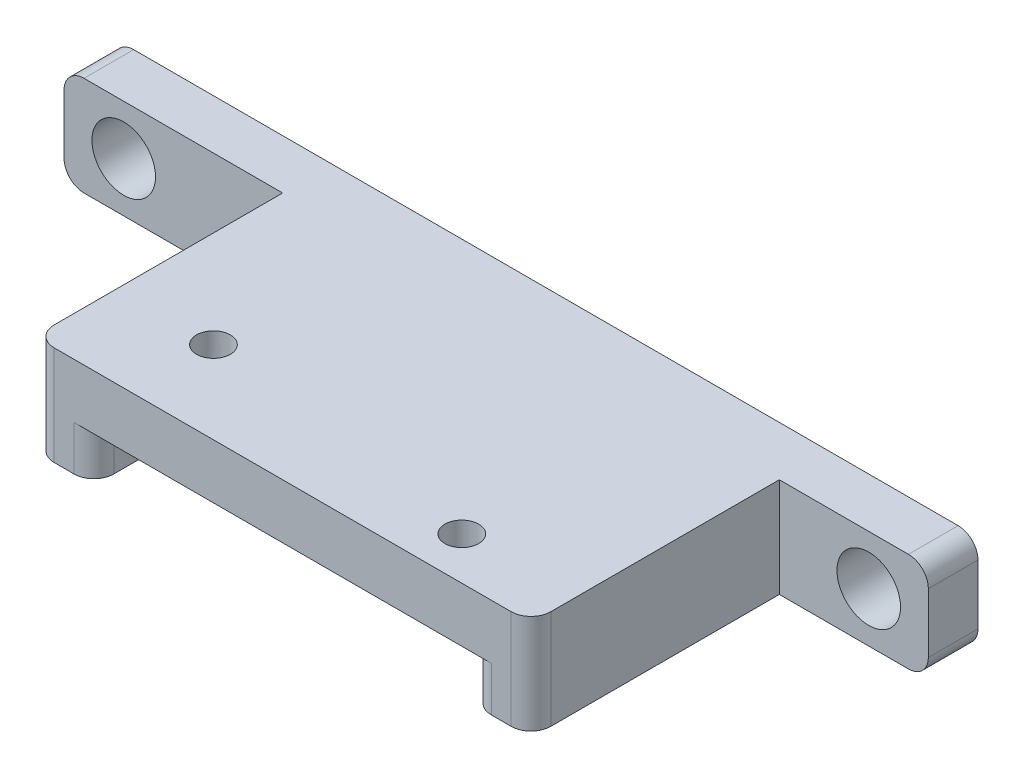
ISO-10303-21;
HEADER;
FILE_DESCRIPTION(('STEP AP214'),'2;1');
FILE_NAME('part.step','',(''),(''),'','','');
FILE_SCHEMA(('AUTOMOTIVE_DESIGN { 1 0 10303 214 1 1 1 1 }'));
ENDSEC;
DATA;
#1=APPLICATION_CONTEXT('core data for automotive mechanical design processes');
#2=APPLICATION_PROTOCOL_DEFINITION('international standard','automotive_design',2000,#1);
#3=PRODUCT_CONTEXT('',#1,'mechanical');
#4=PRODUCT('Part','Part','',(#3));
#5=PRODUCT_RELATED_PRODUCT_CATEGORY('part','',(#4));
#6=PRODUCT_DEFINITION_FORMATION('','',#4);
#7=PRODUCT_DEFINITION_CONTEXT('part definition',#1,'design');
#8=PRODUCT_DEFINITION('design','',#6,#7);
#9=PRODUCT_DEFINITION_SHAPE('','',#8);
#10=(LENGTH_UNIT() NAMED_UNIT(*) SI_UNIT(.MILLI.,.METRE.));
#11=(NAMED_UNIT(*) PLANE_ANGLE_UNIT() SI_UNIT($,.RADIAN.));
#12=(NAMED_UNIT(*) SI_UNIT($,.STERADIAN.) SOLID_ANGLE_UNIT());
#13=UNCERTAINTY_MEASURE_WITH_UNIT(LENGTH_MEASURE(1.E-05),#10,'distance_accuracy_value','');
#14=(GEOMETRIC_REPRESENTATION_CONTEXT(3) GLOBAL_UNCERTAINTY_ASSIGNED_CONTEXT((#13)) GLOBAL_UNIT_ASSIGNED_CONTEXT((#10,
#11,#12)) REPRESENTATION_CONTEXT('',''));
#15=CARTESIAN_POINT('',(0.,0.,0.));
#16=DIRECTION('',(0.,0.,1.));
#17=DIRECTION('',(1.,0.,0.));
#18=AXIS2_PLACEMENT_3D('',#15,#16,#17);
#19=CARTESIAN_POINT('',(40.,10.,-15.));
#20=DIRECTION('',(-1.,0.,0.));
#21=DIRECTION('',(0.,0.,1.));
#22=AXIS2_PLACEMENT_3D('',#19,#20,#21);
#23=PLANE('',#22);
#24=DIRECTION('',(0.,1.,0.));
#25=VECTOR('',#24,1.);
#26=CARTESIAN_POINT('',(40.,0.,-10.));
#27=LINE('',#26,#25);
#28=CARTESIAN_POINT('',(40.,2.,-10.));
#29=VERTEX_POINT('',#28);
#30=CARTESIAN_POINT('',(40.,8.,-10.));
#31=VERTEX_POINT('',#30);
#32=EDGE_CURVE('E214',#29,#31,#27,.T.);
#33=ORIENTED_EDGE('',*,*,#32,.F.);
#34=DIRECTION('',(0.,0.,-1.));
#35=VECTOR('',#34,1.);
#36=CARTESIAN_POINT('',(40.,2.,-15.));
#37=LINE('',#36,#35);
#38=CARTESIAN_POINT('',(40.,2.,-15.));
#39=VERTEX_POINT('',#38);
#40=EDGE_CURVE('E356',#29,#39,#37,.T.);
#41=ORIENTED_EDGE('',*,*,#40,.T.);
#42=DIRECTION('',(0.,-1.,0.));
#43=VECTOR('',#42,1.);
#44=CARTESIAN_POINT('',(40.,10.,-15.));
#45=LINE('',#44,#43);
#46=CARTESIAN_POINT('',(40.,8.,-15.));
#47=VERTEX_POINT('',#46);
#48=EDGE_CURVE('E286',#47,#39,#45,.T.);
#49=ORIENTED_EDGE('',*,*,#48,.F.);
#50=DIRECTION('',(0.,0.,-1.));
#51=VECTOR('',#50,1.);
#52=CARTESIAN_POINT('',(40.,8.,-10.));
#53=LINE('',#52,#51);
#54=EDGE_CURVE('E49',#47,#31,#53,.F.);
#55=ORIENTED_EDGE('',*,*,#54,.T.);
#56=EDGE_LOOP('',(#33,#41,#49,#55));
#57=FACE_BOUND('',#56,.T.);
#58=ADVANCED_FACE('F34',(#57),#23,.F.);
#59=CARTESIAN_POINT('',(-40.,10.,-15.));
#60=DIRECTION('',(0.,0.,1.));
#61=DIRECTION('',(1.,0.,0.));
#62=AXIS2_PLACEMENT_3D('',#59,#60,#61);
#63=PLANE('',#62);
#64=CARTESIAN_POINT('',(-41.,4.99999999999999,-15.));
#65=DIRECTION('',(0.,0.,1.));
#66=DIRECTION('',(1.,0.,0.));
#67=AXIS2_PLACEMENT_3D('',#64,#65,#66);
#68=CIRCLE('',#67,3.2);
#69=CARTESIAN_POINT('',(-37.8,4.99999999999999,-15.));
#70=VERTEX_POINT('',#69);
#71=EDGE_CURVE('E408',#70,#70,#68,.T.);
#72=ORIENTED_EDGE('',*,*,#71,.T.);
#73=EDGE_LOOP('',(#72));
#74=FACE_BOUND('',#73,.T.);
#75=CARTESIAN_POINT('',(34.,5.,-15.));
#76=DIRECTION('',(0.,0.,1.));
#77=DIRECTION('',(1.,0.,0.));
#78=AXIS2_PLACEMENT_3D('',#75,#76,#77);
#79=CIRCLE('',#78,3.2);
#80=CARTESIAN_POINT('',(37.2,5.,-15.));
#81=VERTEX_POINT('',#80);
#82=EDGE_CURVE('E400',#81,#81,#79,.T.);
#83=ORIENTED_EDGE('',*,*,#82,.T.);
#84=EDGE_LOOP('',(#83));
#85=FACE_BOUND('',#84,.T.);
#86=DIRECTION('',(-1.,0.,0.));
#87=VECTOR('',#86,1.);
#88=CARTESIAN_POINT('',(-40.,0.,-15.));
#89=LINE('',#88,#87);
#90=CARTESIAN_POINT('',(38.,0.,-15.));
#91=VERTEX_POINT('',#90);
#92=CARTESIAN_POINT('',(-45.,0.,-15.));
#93=VERTEX_POINT('',#92);
#94=EDGE_CURVE('E276',#91,#93,#89,.T.);
#95=ORIENTED_EDGE('',*,*,#94,.T.);
#96=CARTESIAN_POINT('',(-45.,2.,-15.));
#97=DIRECTION('',(0.,0.,1.));
#98=DIRECTION('',(1.,0.,0.));
#99=AXIS2_PLACEMENT_3D('',#96,#97,#98);
#100=CIRCLE('',#99,2.);
#101=CARTESIAN_POINT('',(-47.,2.,-15.));
#102=VERTEX_POINT('',#101);
#103=EDGE_CURVE('E353',#93,#102,#100,.F.);
#104=ORIENTED_EDGE('',*,*,#103,.T.);
#105=DIRECTION('',(0.,-1.,0.));
#106=VECTOR('',#105,1.);
#107=CARTESIAN_POINT('',(-47.,10.,-15.));
#108=LINE('',#107,#106);
#109=CARTESIAN_POINT('',(-47.,8.,-15.));
#110=VERTEX_POINT('',#109);
#111=EDGE_CURVE('E394',#110,#102,#108,.T.);
#112=ORIENTED_EDGE('',*,*,#111,.F.);
#113=CARTESIAN_POINT('',(-45.,8.,-15.));
#114=DIRECTION('',(0.,0.,1.));
#115=DIRECTION('',(1.,0.,0.));
#116=AXIS2_PLACEMENT_3D('',#113,#114,#115);
#117=CIRCLE('',#116,2.);
#118=CARTESIAN_POINT('',(-45.,10.,-15.));
#119=VERTEX_POINT('',#118);
#120=EDGE_CURVE('E351',#110,#119,#117,.F.);
#121=ORIENTED_EDGE('',*,*,#120,.T.);
#122=DIRECTION('',(-1.,0.,0.));
#123=VECTOR('',#122,1.);
#124=CARTESIAN_POINT('',(-40.,10.,-15.));
#125=LINE('',#124,#123);
#126=CARTESIAN_POINT('',(38.,10.,-15.));
#127=VERTEX_POINT('',#126);
#128=EDGE_CURVE('E279',#127,#119,#125,.T.);
#129=ORIENTED_EDGE('',*,*,#128,.F.);
#130=CARTESIAN_POINT('',(38.,8.,-15.));
#131=DIRECTION('',(0.,0.,1.));
#132=DIRECTION('',(1.,0.,0.));
#133=AXIS2_PLACEMENT_3D('',#130,#131,#132);
#134=CIRCLE('',#133,2.);
#135=EDGE_CURVE('E347',#127,#47,#134,.F.);
#136=ORIENTED_EDGE('',*,*,#135,.T.);
#137=ORIENTED_EDGE('',*,*,#48,.T.);
#138=CARTESIAN_POINT('',(38.,2.,-15.));
#139=DIRECTION('',(0.,0.,1.));
#140=DIRECTION('',(1.,0.,0.));
#141=AXIS2_PLACEMENT_3D('',#138,#139,#140);
#142=CIRCLE('',#141,2.);
#143=EDGE_CURVE('E349',#39,#91,#142,.F.);
#144=ORIENTED_EDGE('',*,*,#143,.T.);
#145=EDGE_LOOP('',(#95,#104,#112,#121,#129,#136,#137,#144));
#146=FACE_BOUND('',#145,.T.);
#147=ADVANCED_FACE('F397',(#74,#85,#146),#63,.F.);
#148=CARTESIAN_POINT('',(-40.,10.,15.));
#149=DIRECTION('',(0.,0.,-1.));
#150=DIRECTION('',(-1.,0.,0.));
#151=AXIS2_PLACEMENT_3D('',#148,#149,#150);
#152=PLANE('',#151);
#153=DIRECTION('',(1.,0.,0.));
#154=VECTOR('',#153,1.);
#155=CARTESIAN_POINT('',(-40.,0.,15.));
#156=LINE('',#155,#154);
#157=CARTESIAN_POINT('',(-23.,0.,15.));
#158=VERTEX_POINT('',#157);
#159=CARTESIAN_POINT('',(-21.,0.,15.));
#160=VERTEX_POINT('',#159);
#161=EDGE_CURVE('E283',#158,#160,#156,.T.);
#162=ORIENTED_EDGE('',*,*,#161,.T.);
#163=DIRECTION('',(0.,-1.,0.));
#164=VECTOR('',#163,1.);
#165=CARTESIAN_POINT('',(-21.,10.,15.));
#166=LINE('',#165,#164);
#167=CARTESIAN_POINT('',(-21.,4.5,15.));
#168=VERTEX_POINT('',#167);
#169=EDGE_CURVE('E319',#160,#168,#166,.F.);
#170=ORIENTED_EDGE('',*,*,#169,.T.);
#171=DIRECTION('',(-1.,0.,0.));
#172=VECTOR('',#171,1.);
#173=CARTESIAN_POINT('',(-19.,4.5,15.));
#174=LINE('',#173,#172);
#175=CARTESIAN_POINT('',(21.,4.5,15.));
#176=VERTEX_POINT('',#175);
#177=EDGE_CURVE('E263',#176,#168,#174,.T.);
#178=ORIENTED_EDGE('',*,*,#177,.F.);
#179=DIRECTION('',(0.,-1.,0.));
#180=VECTOR('',#179,1.);
#181=CARTESIAN_POINT('',(21.,10.,15.));
#182=LINE('',#181,#180);
#183=CARTESIAN_POINT('',(21.,0.,15.));
#184=VERTEX_POINT('',#183);
#185=EDGE_CURVE('E316',#176,#184,#182,.T.);
#186=ORIENTED_EDGE('',*,*,#185,.T.);
#187=CARTESIAN_POINT('',(23.,0.,15.));
#188=VERTEX_POINT('',#187);
#189=EDGE_CURVE('E289',#184,#188,#156,.T.);
#190=ORIENTED_EDGE('',*,*,#189,.T.);
#191=DIRECTION('',(0.,-1.,0.));
#192=VECTOR('',#191,1.);
#193=CARTESIAN_POINT('',(23.,10.,15.));
#194=LINE('',#193,#192);
#195=CARTESIAN_POINT('',(23.,10.,15.));
#196=VERTEX_POINT('',#195);
#197=EDGE_CURVE('E312',#188,#196,#194,.F.);
#198=ORIENTED_EDGE('',*,*,#197,.T.);
#199=DIRECTION('',(1.,0.,0.));
#200=VECTOR('',#199,1.);
#201=CARTESIAN_POINT('',(-40.,10.,15.));
#202=LINE('',#201,#200);
#203=CARTESIAN_POINT('',(-23.,10.,15.));
#204=VERTEX_POINT('',#203);
#205=EDGE_CURVE('E282',#204,#196,#202,.T.);
#206=ORIENTED_EDGE('',*,*,#205,.F.);
#207=DIRECTION('',(0.,1.,0.));
#208=VECTOR('',#207,1.);
#209=CARTESIAN_POINT('',(-23.,10.,15.));
#210=LINE('',#209,#208);
#211=EDGE_CURVE('E314',#204,#158,#210,.F.);
#212=ORIENTED_EDGE('',*,*,#211,.T.);
#213=EDGE_LOOP('',(#162,#170,#178,#186,#190,#198,#206,#212));
#214=FACE_BOUND('',#213,.T.);
#215=ADVANCED_FACE('F376',(#214),#152,.F.);
#216=CARTESIAN_POINT('',(0.,10.,0.));
#217=DIRECTION('',(0.,1.,0.));
#218=DIRECTION('',(0.,0.,1.));
#219=AXIS2_PLACEMENT_3D('',#216,#217,#218);
#220=PLANE('',#219);
#221=DIRECTION('',(0.,0.,1.));
#222=VECTOR('',#221,1.);
#223=CARTESIAN_POINT('',(-25.,10.,-10.));
#224=LINE('',#223,#222);
#225=CARTESIAN_POINT('',(-25.,10.,-10.));
#226=VERTEX_POINT('',#225);
#227=CARTESIAN_POINT('',(-25.,10.,13.));
#228=VERTEX_POINT('',#227);
#229=EDGE_CURVE('E205',#226,#228,#224,.T.);
#230=ORIENTED_EDGE('',*,*,#229,.T.);
#231=CARTESIAN_POINT('',(-23.,10.,13.));
#232=DIRECTION('',(0.,1.,0.));
#233=DIRECTION('',(0.,0.,1.));
#234=AXIS2_PLACEMENT_3D('',#231,#232,#233);
#235=CIRCLE('',#234,2.);
#236=EDGE_CURVE('E333',#228,#204,#235,.T.);
#237=ORIENTED_EDGE('',*,*,#236,.T.);
#238=ORIENTED_EDGE('',*,*,#205,.T.);
#239=CARTESIAN_POINT('',(23.,10.,13.));
#240=DIRECTION('',(0.,1.,0.));
#241=DIRECTION('',(0.,0.,1.));
#242=AXIS2_PLACEMENT_3D('',#239,#240,#241);
#243=CIRCLE('',#242,2.);
#244=CARTESIAN_POINT('',(25.,10.,13.));
#245=VERTEX_POINT('',#244);
#246=EDGE_CURVE('E331',#196,#245,#243,.T.);
#247=ORIENTED_EDGE('',*,*,#246,.T.);
#248=DIRECTION('',(0.,0.,1.));
#249=VECTOR('',#248,1.);
#250=CARTESIAN_POINT('',(25.,10.,-10.));
#251=LINE('',#250,#249);
#252=CARTESIAN_POINT('',(25.,10.,-10.));
#253=VERTEX_POINT('',#252);
#254=EDGE_CURVE('E225',#253,#245,#251,.T.);
#255=ORIENTED_EDGE('',*,*,#254,.F.);
#256=DIRECTION('',(-1.,0.,0.));
#257=VECTOR('',#256,1.);
#258=CARTESIAN_POINT('',(40.,10.,-10.));
#259=LINE('',#258,#257);
#260=CARTESIAN_POINT('',(38.,10.,-10.));
#261=VERTEX_POINT('',#260);
#262=EDGE_CURVE('E219',#261,#253,#259,.T.);
#263=ORIENTED_EDGE('',*,*,#262,.F.);
#264=DIRECTION('',(0.,0.,-1.));
#265=VECTOR('',#264,1.);
#266=CARTESIAN_POINT('',(38.,10.,-15.));
#267=LINE('',#266,#265);
#268=EDGE_CURVE('E326',#261,#127,#267,.T.);
#269=ORIENTED_EDGE('',*,*,#268,.T.);
#270=ORIENTED_EDGE('',*,*,#128,.T.);
#271=DIRECTION('',(0.,0.,-1.));
#272=VECTOR('',#271,1.);
#273=CARTESIAN_POINT('',(-45.,10.,0.));
#274=LINE('',#273,#272);
#275=CARTESIAN_POINT('',(-45.,10.,-10.));
#276=VERTEX_POINT('',#275);
#277=EDGE_CURVE('E329',#119,#276,#274,.F.);
#278=ORIENTED_EDGE('',*,*,#277,.T.);
#279=DIRECTION('',(-1.,0.,0.));
#280=VECTOR('',#279,1.);
#281=CARTESIAN_POINT('',(-40.,10.,-10.));
#282=LINE('',#281,#280);
#283=EDGE_CURVE('E206',#226,#276,#282,.T.);
#284=ORIENTED_EDGE('',*,*,#283,.F.);
#285=EDGE_LOOP('',(#230,#237,#238,#247,#255,#263,#269,#270,#278,#284));
#286=FACE_BOUND('',#285,.T.);
#287=CARTESIAN_POINT('',(-15.2672128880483,10.,6.7));
#288=DIRECTION('',(0.,1.,0.));
#289=DIRECTION('',(0.,0.,1.));
#290=AXIS2_PLACEMENT_3D('',#287,#288,#289);
#291=CIRCLE('',#290,1.7);
#292=CARTESIAN_POINT('',(-15.2672128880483,10.,8.4));
#293=VERTEX_POINT('',#292);
#294=EDGE_CURVE('E246',#293,#293,#291,.T.);
#295=ORIENTED_EDGE('',*,*,#294,.F.);
#296=EDGE_LOOP('',(#295));
#297=FACE_BOUND('',#296,.T.);
#298=CARTESIAN_POINT('',(13.7327871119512,10.,10.7000000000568));
#299=DIRECTION('',(0.,1.,0.));
#300=DIRECTION('',(0.,0.,1.));
#301=AXIS2_PLACEMENT_3D('',#298,#299,#300);
#302=CIRCLE('',#301,1.7);
#303=CARTESIAN_POINT('',(13.7327871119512,10.,12.4000000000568));
#304=VERTEX_POINT('',#303);
#305=EDGE_CURVE('E250',#304,#304,#302,.T.);
#306=ORIENTED_EDGE('',*,*,#305,.F.);
#307=EDGE_LOOP('',(#306));
#308=FACE_BOUND('',#307,.T.);
#309=ADVANCED_FACE('F382',(#286,#297,#308),#220,.T.);
#310=CARTESIAN_POINT('',(0.,0.,0.));
#311=DIRECTION('',(0.,1.,0.));
#312=DIRECTION('',(0.,0.,1.));
#313=AXIS2_PLACEMENT_3D('',#310,#311,#312);
#314=PLANE('',#313);
#315=DIRECTION('',(0.,0.,-1.));
#316=VECTOR('',#315,1.);
#317=CARTESIAN_POINT('',(-19.,0.,15.));
#318=LINE('',#317,#316);
#319=CARTESIAN_POINT('',(-19.,0.,13.));
#320=VERTEX_POINT('',#319);
#321=CARTESIAN_POINT('',(-19.,0.,-3.));
#322=VERTEX_POINT('',#321);
#323=EDGE_CURVE('E266',#320,#322,#318,.T.);
#324=ORIENTED_EDGE('',*,*,#323,.F.);
#325=CARTESIAN_POINT('',(-21.,0.,13.));
#326=DIRECTION('',(0.,1.,0.));
#327=DIRECTION('',(0.,0.,1.));
#328=AXIS2_PLACEMENT_3D('',#325,#326,#327);
#329=CIRCLE('',#328,2.);
#330=EDGE_CURVE('E310',#320,#160,#329,.F.);
#331=ORIENTED_EDGE('',*,*,#330,.T.);
#332=ORIENTED_EDGE('',*,*,#161,.F.);
#333=CARTESIAN_POINT('',(-23.,0.,13.));
#334=DIRECTION('',(0.,1.,0.));
#335=DIRECTION('',(0.,0.,1.));
#336=AXIS2_PLACEMENT_3D('',#333,#334,#335);
#337=CIRCLE('',#336,2.);
#338=CARTESIAN_POINT('',(-25.,0.,13.));
#339=VERTEX_POINT('',#338);
#340=EDGE_CURVE('E212',#158,#339,#337,.F.);
#341=ORIENTED_EDGE('',*,*,#340,.T.);
#342=DIRECTION('',(0.,0.,1.));
#343=VECTOR('',#342,1.);
#344=CARTESIAN_POINT('',(-25.,0.,-10.));
#345=LINE('',#344,#343);
#346=CARTESIAN_POINT('',(-25.,0.,-10.));
#347=VERTEX_POINT('',#346);
#348=EDGE_CURVE('E202',#347,#339,#345,.T.);
#349=ORIENTED_EDGE('',*,*,#348,.F.);
#350=DIRECTION('',(1.,0.,0.));
#351=VECTOR('',#350,1.);
#352=CARTESIAN_POINT('',(-40.,0.,-10.));
#353=LINE('',#352,#351);
#354=CARTESIAN_POINT('',(-45.,0.,-10.));
#355=VERTEX_POINT('',#354);
#356=EDGE_CURVE('E185',#355,#347,#353,.T.);
#357=ORIENTED_EDGE('',*,*,#356,.F.);
#358=DIRECTION('',(0.,0.,1.));
#359=VECTOR('',#358,1.);
#360=CARTESIAN_POINT('',(-45.,0.,-15.));
#361=LINE('',#360,#359);
#362=EDGE_CURVE('E303',#355,#93,#361,.F.);
#363=ORIENTED_EDGE('',*,*,#362,.T.);
#364=ORIENTED_EDGE('',*,*,#94,.F.);
#365=DIRECTION('',(0.,0.,-1.));
#366=VECTOR('',#365,1.);
#367=CARTESIAN_POINT('',(38.,0.,0.));
#368=LINE('',#367,#366);
#369=CARTESIAN_POINT('',(38.,0.,-10.));
#370=VERTEX_POINT('',#369);
#371=EDGE_CURVE('E301',#91,#370,#368,.F.);
#372=ORIENTED_EDGE('',*,*,#371,.T.);
#373=DIRECTION('',(1.,0.,0.));
#374=VECTOR('',#373,1.);
#375=CARTESIAN_POINT('',(40.,0.,-10.));
#376=LINE('',#375,#374);
#377=CARTESIAN_POINT('',(25.,0.,-10.));
#378=VERTEX_POINT('',#377);
#379=EDGE_CURVE('E223',#378,#370,#376,.T.);
#380=ORIENTED_EDGE('',*,*,#379,.F.);
#381=DIRECTION('',(0.,0.,1.));
#382=VECTOR('',#381,1.);
#383=CARTESIAN_POINT('',(25.,0.,-10.));
#384=LINE('',#383,#382);
#385=CARTESIAN_POINT('',(25.,0.,13.));
#386=VERTEX_POINT('',#385);
#387=EDGE_CURVE('E226',#378,#386,#384,.T.);
#388=ORIENTED_EDGE('',*,*,#387,.T.);
#389=CARTESIAN_POINT('',(23.,0.,13.));
#390=DIRECTION('',(0.,1.,0.));
#391=DIRECTION('',(0.,0.,1.));
#392=AXIS2_PLACEMENT_3D('',#389,#390,#391);
#393=CIRCLE('',#392,2.);
#394=EDGE_CURVE('E305',#386,#188,#393,.F.);
#395=ORIENTED_EDGE('',*,*,#394,.T.);
#396=ORIENTED_EDGE('',*,*,#189,.F.);
#397=CARTESIAN_POINT('',(21.,0.,13.));
#398=DIRECTION('',(0.,1.,0.));
#399=DIRECTION('',(0.,0.,1.));
#400=AXIS2_PLACEMENT_3D('',#397,#398,#399);
#401=CIRCLE('',#400,2.);
#402=CARTESIAN_POINT('',(19.,0.,13.));
#403=VERTEX_POINT('',#402);
#404=EDGE_CURVE('E308',#184,#403,#401,.F.);
#405=ORIENTED_EDGE('',*,*,#404,.T.);
#406=DIRECTION('',(0.,0.,1.));
#407=VECTOR('',#406,1.);
#408=CARTESIAN_POINT('',(19.,0.,15.));
#409=LINE('',#408,#407);
#410=CARTESIAN_POINT('',(19.,0.,-3.));
#411=VERTEX_POINT('',#410);
#412=EDGE_CURVE('E257',#411,#403,#409,.T.);
#413=ORIENTED_EDGE('',*,*,#412,.F.);
#414=CARTESIAN_POINT('',(17.,0.,-3.));
#415=DIRECTION('',(0.,-1.,0.));
#416=DIRECTION('',(0.,0.,-1.));
#417=AXIS2_PLACEMENT_3D('',#414,#415,#416);
#418=CIRCLE('',#417,2.);
#419=CARTESIAN_POINT('',(15.,0.,-3.));
#420=VERTEX_POINT('',#419);
#421=EDGE_CURVE('E229',#420,#411,#418,.T.);
#422=ORIENTED_EDGE('',*,*,#421,.F.);
#423=DIRECTION('',(1.,0.,0.));
#424=VECTOR('',#423,1.);
#425=CARTESIAN_POINT('',(-19.,0.,-3.));
#426=LINE('',#425,#424);
#427=CARTESIAN_POINT('',(-15.,0.,-3.));
#428=VERTEX_POINT('',#427);
#429=EDGE_CURVE('E268',#428,#420,#426,.T.);
#430=ORIENTED_EDGE('',*,*,#429,.F.);
#431=CARTESIAN_POINT('',(-17.,0.,-3.));
#432=DIRECTION('',(0.,-1.,0.));
#433=DIRECTION('',(0.,0.,-1.));
#434=AXIS2_PLACEMENT_3D('',#431,#432,#433);
#435=CIRCLE('',#434,2.);
#436=EDGE_CURVE('E238',#322,#428,#435,.T.);
#437=ORIENTED_EDGE('',*,*,#436,.F.);
#438=EDGE_LOOP('',(#324,#331,#332,#341,#349,#357,#363,#364,#372,#380,#388,#395,#396,#405,#413,
#422,#430,#437));
#439=FACE_BOUND('',#438,.T.);
#440=ADVANCED_FACE('F209',(#439),#314,.F.);
#441=CARTESIAN_POINT('',(-19.,4.5,15.));
#442=DIRECTION('',(-1.,0.,0.));
#443=DIRECTION('',(0.,0.,1.));
#444=AXIS2_PLACEMENT_3D('',#441,#442,#443);
#445=PLANE('',#444);
#446=DIRECTION('',(0.,0.,-1.));
#447=VECTOR('',#446,1.);
#448=CARTESIAN_POINT('',(-19.,4.5,15.));
#449=LINE('',#448,#447);
#450=CARTESIAN_POINT('',(-19.,4.5,13.));
#451=VERTEX_POINT('',#450);
#452=CARTESIAN_POINT('',(-19.,4.5,-3.));
#453=VERTEX_POINT('',#452);
#454=EDGE_CURVE('E254',#451,#453,#449,.T.);
#455=ORIENTED_EDGE('',*,*,#454,.F.);
#456=DIRECTION('',(0.,-1.,0.));
#457=VECTOR('',#456,1.);
#458=CARTESIAN_POINT('',(-19.,4.5,13.));
#459=LINE('',#458,#457);
#460=EDGE_CURVE('E294',#451,#320,#459,.T.);
#461=ORIENTED_EDGE('',*,*,#460,.T.);
#462=ORIENTED_EDGE('',*,*,#323,.T.);
#463=DIRECTION('',(0.,-1.,0.));
#464=VECTOR('',#463,1.);
#465=CARTESIAN_POINT('',(-19.,4.5,-3.));
#466=LINE('',#465,#464);
#467=EDGE_CURVE('E265',#453,#322,#466,.T.);
#468=ORIENTED_EDGE('',*,*,#467,.F.);
#469=EDGE_LOOP('',(#455,#461,#462,#468));
#470=FACE_BOUND('',#469,.T.);
#471=ADVANCED_FACE('F371',(#470),#445,.F.);
#472=CARTESIAN_POINT('',(19.,4.5,15.));
#473=DIRECTION('',(1.,0.,0.));
#474=DIRECTION('',(0.,0.,-1.));
#475=AXIS2_PLACEMENT_3D('',#472,#473,#474);
#476=PLANE('',#475);
#477=ORIENTED_EDGE('',*,*,#412,.T.);
#478=DIRECTION('',(0.,-1.,0.));
#479=VECTOR('',#478,1.);
#480=CARTESIAN_POINT('',(19.,4.5,13.));
#481=LINE('',#480,#479);
#482=CARTESIAN_POINT('',(19.,4.5,13.));
#483=VERTEX_POINT('',#482);
#484=EDGE_CURVE('E322',#403,#483,#481,.F.);
#485=ORIENTED_EDGE('',*,*,#484,.T.);
#486=DIRECTION('',(0.,0.,1.));
#487=VECTOR('',#486,1.);
#488=CARTESIAN_POINT('',(19.,4.5,15.));
#489=LINE('',#488,#487);
#490=CARTESIAN_POINT('',(19.,4.5,-3.));
#491=VERTEX_POINT('',#490);
#492=EDGE_CURVE('E260',#491,#483,#489,.T.);
#493=ORIENTED_EDGE('',*,*,#492,.F.);
#494=DIRECTION('',(0.,-1.,0.));
#495=VECTOR('',#494,1.);
#496=CARTESIAN_POINT('',(19.,4.5,-3.));
#497=LINE('',#496,#495);
#498=EDGE_CURVE('E273',#491,#411,#497,.T.);
#499=ORIENTED_EDGE('',*,*,#498,.T.);
#500=EDGE_LOOP('',(#477,#485,#493,#499));
#501=FACE_BOUND('',#500,.T.);
#502=ADVANCED_FACE('F488',(#501),#476,.F.);
#503=CARTESIAN_POINT('',(-19.,4.5,-3.));
#504=DIRECTION('',(0.,0.,-1.));
#505=DIRECTION('',(-1.,0.,0.));
#506=AXIS2_PLACEMENT_3D('',#503,#504,#505);
#507=PLANE('',#506);
#508=ORIENTED_EDGE('',*,*,#429,.T.);
#509=DIRECTION('',(0.,-1.,0.));
#510=VECTOR('',#509,1.);
#511=CARTESIAN_POINT('',(15.,10.1568542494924,-3.));
#512=LINE('',#511,#510);
#513=CARTESIAN_POINT('',(15.,4.5,-3.));
#514=VERTEX_POINT('',#513);
#515=EDGE_CURVE('E235',#420,#514,#512,.F.);
#516=ORIENTED_EDGE('',*,*,#515,.T.);
#517=DIRECTION('',(1.,0.,0.));
#518=VECTOR('',#517,1.);
#519=CARTESIAN_POINT('',(-19.,4.5,-3.));
#520=LINE('',#519,#518);
#521=CARTESIAN_POINT('',(-15.,4.5,-3.));
#522=VERTEX_POINT('',#521);
#523=EDGE_CURVE('E256',#522,#514,#520,.T.);
#524=ORIENTED_EDGE('',*,*,#523,.F.);
#525=DIRECTION('',(0.,-1.,0.));
#526=VECTOR('',#525,1.);
#527=CARTESIAN_POINT('',(-15.,10.1568542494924,-3.));
#528=LINE('',#527,#526);
#529=EDGE_CURVE('E243',#522,#428,#528,.T.);
#530=ORIENTED_EDGE('',*,*,#529,.T.);
#531=EDGE_LOOP('',(#508,#516,#524,#530));
#532=FACE_BOUND('',#531,.T.);
#533=ADVANCED_FACE('F495',(#532),#507,.F.);
#534=CARTESIAN_POINT('',(0.,4.5,0.));
#535=DIRECTION('',(0.,-1.,0.));
#536=DIRECTION('',(0.,0.,-1.));
#537=AXIS2_PLACEMENT_3D('',#534,#535,#536);
#538=PLANE('',#537);
#539=ORIENTED_EDGE('',*,*,#523,.T.);
#540=CARTESIAN_POINT('',(17.,4.5,-3.));
#541=DIRECTION('',(0.,-1.,0.));
#542=DIRECTION('',(0.,0.,-1.));
#543=AXIS2_PLACEMENT_3D('',#540,#541,#542);
#544=CIRCLE('',#543,2.);
#545=EDGE_CURVE('E233',#491,#514,#544,.F.);
#546=ORIENTED_EDGE('',*,*,#545,.F.);
#547=ORIENTED_EDGE('',*,*,#492,.T.);
#548=CARTESIAN_POINT('',(21.,4.5,13.));
#549=DIRECTION('',(0.,-1.,0.));
#550=DIRECTION('',(0.,0.,-1.));
#551=AXIS2_PLACEMENT_3D('',#548,#549,#550);
#552=CIRCLE('',#551,2.);
#553=EDGE_CURVE('E11',#483,#176,#552,.F.);
#554=ORIENTED_EDGE('',*,*,#553,.T.);
#555=ORIENTED_EDGE('',*,*,#177,.T.);
#556=CARTESIAN_POINT('',(-21.,4.5,13.));
#557=DIRECTION('',(0.,-1.,0.));
#558=DIRECTION('',(0.,0.,-1.));
#559=AXIS2_PLACEMENT_3D('',#556,#557,#558);
#560=CIRCLE('',#559,2.);
#561=EDGE_CURVE('E42',#168,#451,#560,.F.);
#562=ORIENTED_EDGE('',*,*,#561,.T.);
#563=ORIENTED_EDGE('',*,*,#454,.T.);
#564=CARTESIAN_POINT('',(-17.,4.5,-3.));
#565=DIRECTION('',(0.,-1.,0.));
#566=DIRECTION('',(0.,0.,-1.));
#567=AXIS2_PLACEMENT_3D('',#564,#565,#566);
#568=CIRCLE('',#567,2.);
#569=EDGE_CURVE('E240',#522,#453,#568,.F.);
#570=ORIENTED_EDGE('',*,*,#569,.F.);
#571=EDGE_LOOP('',(#539,#546,#547,#554,#555,#562,#563,#570));
#572=FACE_BOUND('',#571,.T.);
#573=CARTESIAN_POINT('',(-15.2672128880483,4.5,6.7));
#574=DIRECTION('',(0.,-1.,0.));
#575=DIRECTION('',(0.,0.,-1.));
#576=AXIS2_PLACEMENT_3D('',#573,#574,#575);
#577=CIRCLE('',#576,1.7);
#578=CARTESIAN_POINT('',(-15.2672128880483,4.5,5.));
#579=VERTEX_POINT('',#578);
#580=EDGE_CURVE('E249',#579,#579,#577,.T.);
#581=ORIENTED_EDGE('',*,*,#580,.F.);
#582=EDGE_LOOP('',(#581));
#583=FACE_BOUND('',#582,.T.);
#584=CARTESIAN_POINT('',(13.7327871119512,4.5,10.7000000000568));
#585=DIRECTION('',(0.,-1.,0.));
#586=DIRECTION('',(0.,0.,-1.));
#587=AXIS2_PLACEMENT_3D('',#584,#585,#586);
#588=CIRCLE('',#587,1.7);
#589=CARTESIAN_POINT('',(13.7327871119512,4.5,9.00000000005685));
#590=VERTEX_POINT('',#589);
#591=EDGE_CURVE('E253',#590,#590,#588,.T.);
#592=ORIENTED_EDGE('',*,*,#591,.F.);
#593=EDGE_LOOP('',(#592));
#594=FACE_BOUND('',#593,.T.);
#595=ADVANCED_FACE('F364',(#572,#583,#594),#538,.T.);
#596=CARTESIAN_POINT('',(13.7327871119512,0.,10.7000000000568));
#597=DIRECTION('',(0.,1.,0.));
#598=DIRECTION('',(0.,0.,1.));
#599=AXIS2_PLACEMENT_3D('',#596,#597,#598);
#600=CYLINDRICAL_SURFACE('',#599,1.7);
#601=ORIENTED_EDGE('',*,*,#591,.T.);
#602=EDGE_LOOP('',(#601));
#603=FACE_BOUND('',#602,.T.);
#604=ORIENTED_EDGE('',*,*,#305,.T.);
#605=EDGE_LOOP('',(#604));
#606=FACE_BOUND('',#605,.T.);
#607=ADVANCED_FACE('F508',(#603,#606),#600,.F.);
#608=CARTESIAN_POINT('',(-15.2672128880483,0.,6.7));
#609=DIRECTION('',(0.,1.,0.));
#610=DIRECTION('',(0.,0.,1.));
#611=AXIS2_PLACEMENT_3D('',#608,#609,#610);
#612=CYLINDRICAL_SURFACE('',#611,1.7);
#613=ORIENTED_EDGE('',*,*,#580,.T.);
#614=EDGE_LOOP('',(#613));
#615=FACE_BOUND('',#614,.T.);
#616=ORIENTED_EDGE('',*,*,#294,.T.);
#617=EDGE_LOOP('',(#616));
#618=FACE_BOUND('',#617,.T.);
#619=ADVANCED_FACE('F501',(#615,#618),#612,.F.);
#620=CARTESIAN_POINT('',(-17.,10.1568542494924,-3.));
#621=DIRECTION('',(0.,-1.,0.));
#622=DIRECTION('',(0.,0.,-1.));
#623=AXIS2_PLACEMENT_3D('',#620,#621,#622);
#624=CYLINDRICAL_SURFACE('',#623,2.);
#625=ORIENTED_EDGE('',*,*,#569,.T.);
#626=ORIENTED_EDGE('',*,*,#467,.T.);
#627=ORIENTED_EDGE('',*,*,#436,.T.);
#628=ORIENTED_EDGE('',*,*,#529,.F.);
#629=EDGE_LOOP('',(#625,#626,#627,#628));
#630=FACE_BOUND('',#629,.T.);
#631=ADVANCED_FACE('F499',(#630),#624,.F.);
#632=CARTESIAN_POINT('',(17.,10.1568542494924,-3.));
#633=DIRECTION('',(0.,-1.,0.));
#634=DIRECTION('',(0.,0.,-1.));
#635=AXIS2_PLACEMENT_3D('',#632,#633,#634);
#636=CYLINDRICAL_SURFACE('',#635,2.);
#637=ORIENTED_EDGE('',*,*,#545,.T.);
#638=ORIENTED_EDGE('',*,*,#515,.F.);
#639=ORIENTED_EDGE('',*,*,#421,.T.);
#640=ORIENTED_EDGE('',*,*,#498,.F.);
#641=EDGE_LOOP('',(#637,#638,#639,#640));
#642=FACE_BOUND('',#641,.T.);
#643=ADVANCED_FACE('F492',(#642),#636,.F.);
#644=CARTESIAN_POINT('',(25.,0.,-10.));
#645=DIRECTION('',(-1.,0.,0.));
#646=DIRECTION('',(0.,0.,1.));
#647=AXIS2_PLACEMENT_3D('',#644,#645,#646);
#648=PLANE('',#647);
#649=ORIENTED_EDGE('',*,*,#254,.T.);
#650=DIRECTION('',(0.,-1.,0.));
#651=VECTOR('',#650,1.);
#652=CARTESIAN_POINT('',(25.,0.,13.));
#653=LINE('',#652,#651);
#654=EDGE_CURVE('E335',#245,#386,#653,.T.);
#655=ORIENTED_EDGE('',*,*,#654,.T.);
#656=ORIENTED_EDGE('',*,*,#387,.F.);
#657=DIRECTION('',(0.,-1.,0.));
#658=VECTOR('',#657,1.);
#659=CARTESIAN_POINT('',(25.,0.,-10.));
#660=LINE('',#659,#658);
#661=EDGE_CURVE('E221',#253,#378,#660,.T.);
#662=ORIENTED_EDGE('',*,*,#661,.F.);
#663=EDGE_LOOP('',(#649,#655,#656,#662));
#664=FACE_BOUND('',#663,.T.);
#665=ADVANCED_FACE('F476',(#664),#648,.F.);
#666=CARTESIAN_POINT('',(0.,0.,-10.));
#667=DIRECTION('',(0.,0.,1.));
#668=DIRECTION('',(1.,0.,0.));
#669=AXIS2_PLACEMENT_3D('',#666,#667,#668);
#670=PLANE('',#669);
#671=CARTESIAN_POINT('',(34.,5.,-10.));
#672=DIRECTION('',(0.,0.,1.));
#673=DIRECTION('',(1.,0.,0.));
#674=AXIS2_PLACEMENT_3D('',#671,#672,#673);
#675=CIRCLE('',#674,3.2);
#676=CARTESIAN_POINT('',(37.2,5.,-10.));
#677=VERTEX_POINT('',#676);
#678=EDGE_CURVE('E404',#677,#677,#675,.T.);
#679=ORIENTED_EDGE('',*,*,#678,.F.);
#680=EDGE_LOOP('',(#679));
#681=FACE_BOUND('',#680,.T.);
#682=ORIENTED_EDGE('',*,*,#379,.T.);
#683=CARTESIAN_POINT('',(38.,2.,-10.));
#684=DIRECTION('',(0.,0.,1.));
#685=DIRECTION('',(1.,0.,0.));
#686=AXIS2_PLACEMENT_3D('',#683,#684,#685);
#687=CIRCLE('',#686,2.);
#688=EDGE_CURVE('E56',#370,#29,#687,.T.);
#689=ORIENTED_EDGE('',*,*,#688,.T.);
#690=ORIENTED_EDGE('',*,*,#32,.T.);
#691=CARTESIAN_POINT('',(38.,8.,-10.));
#692=DIRECTION('',(0.,0.,1.));
#693=DIRECTION('',(1.,0.,0.));
#694=AXIS2_PLACEMENT_3D('',#691,#692,#693);
#695=CIRCLE('',#694,2.);
#696=EDGE_CURVE('E359',#31,#261,#695,.T.);
#697=ORIENTED_EDGE('',*,*,#696,.T.);
#698=ORIENTED_EDGE('',*,*,#262,.T.);
#699=ORIENTED_EDGE('',*,*,#661,.T.);
#700=EDGE_LOOP('',(#682,#689,#690,#697,#698,#699));
#701=FACE_BOUND('',#700,.T.);
#702=ADVANCED_FACE('F432',(#681,#701),#670,.T.);
#703=CARTESIAN_POINT('',(-25.,0.,-10.));
#704=DIRECTION('',(1.,0.,0.));
#705=DIRECTION('',(0.,0.,-1.));
#706=AXIS2_PLACEMENT_3D('',#703,#704,#705);
#707=PLANE('',#706);
#708=ORIENTED_EDGE('',*,*,#348,.T.);
#709=DIRECTION('',(0.,1.,0.));
#710=VECTOR('',#709,1.);
#711=CARTESIAN_POINT('',(-25.,0.,13.));
#712=LINE('',#711,#710);
#713=EDGE_CURVE('E324',#339,#228,#712,.T.);
#714=ORIENTED_EDGE('',*,*,#713,.T.);
#715=ORIENTED_EDGE('',*,*,#229,.F.);
#716=DIRECTION('',(0.,1.,0.));
#717=VECTOR('',#716,1.);
#718=CARTESIAN_POINT('',(-25.,0.,-10.));
#719=LINE('',#718,#717);
#720=EDGE_CURVE('E190',#347,#226,#719,.T.);
#721=ORIENTED_EDGE('',*,*,#720,.F.);
#722=EDGE_LOOP('',(#708,#714,#715,#721));
#723=FACE_BOUND('',#722,.T.);
#724=ADVANCED_FACE('F200',(#723),#707,.F.);
#725=CARTESIAN_POINT('',(0.,0.,-10.));
#726=DIRECTION('',(0.,0.,-1.));
#727=DIRECTION('',(-1.,0.,0.));
#728=AXIS2_PLACEMENT_3D('',#725,#726,#727);
#729=PLANE('',#728);
#730=CARTESIAN_POINT('',(-41.,4.99999999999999,-10.));
#731=DIRECTION('',(0.,0.,1.));
#732=DIRECTION('',(1.,0.,0.));
#733=AXIS2_PLACEMENT_3D('',#730,#731,#732);
#734=CIRCLE('',#733,3.2);
#735=CARTESIAN_POINT('',(-37.8,4.99999999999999,-10.));
#736=VERTEX_POINT('',#735);
#737=EDGE_CURVE('E410',#736,#736,#734,.T.);
#738=ORIENTED_EDGE('',*,*,#737,.F.);
#739=EDGE_LOOP('',(#738));
#740=FACE_BOUND('',#739,.T.);
#741=DIRECTION('',(0.,1.,0.));
#742=VECTOR('',#741,1.);
#743=CARTESIAN_POINT('',(-47.,0.,-10.));
#744=LINE('',#743,#742);
#745=CARTESIAN_POINT('',(-47.,2.,-10.));
#746=VERTEX_POINT('',#745);
#747=CARTESIAN_POINT('',(-47.,8.,-10.));
#748=VERTEX_POINT('',#747);
#749=EDGE_CURVE('E196',#746,#748,#744,.T.);
#750=ORIENTED_EDGE('',*,*,#749,.F.);
#751=CARTESIAN_POINT('',(-45.,2.,-10.));
#752=DIRECTION('',(0.,0.,-1.));
#753=DIRECTION('',(-1.,0.,0.));
#754=AXIS2_PLACEMENT_3D('',#751,#752,#753);
#755=CIRCLE('',#754,2.);
#756=EDGE_CURVE('E192',#746,#355,#755,.F.);
#757=ORIENTED_EDGE('',*,*,#756,.T.);
#758=ORIENTED_EDGE('',*,*,#356,.T.);
#759=ORIENTED_EDGE('',*,*,#720,.T.);
#760=ORIENTED_EDGE('',*,*,#283,.T.);
#761=CARTESIAN_POINT('',(-45.,8.,-10.));
#762=DIRECTION('',(0.,0.,-1.));
#763=DIRECTION('',(-1.,0.,0.));
#764=AXIS2_PLACEMENT_3D('',#761,#762,#763);
#765=CIRCLE('',#764,2.);
#766=EDGE_CURVE('E344',#276,#748,#765,.F.);
#767=ORIENTED_EDGE('',*,*,#766,.T.);
#768=EDGE_LOOP('',(#750,#757,#758,#759,#760,#767));
#769=FACE_BOUND('',#768,.T.);
#770=ADVANCED_FACE('F188',(#740,#769),#729,.F.);
#771=CARTESIAN_POINT('',(-47.,0.,0.));
#772=DIRECTION('',(-1.,0.,0.));
#773=DIRECTION('',(0.,0.,1.));
#774=AXIS2_PLACEMENT_3D('',#771,#772,#773);
#775=PLANE('',#774);
#776=ORIENTED_EDGE('',*,*,#111,.T.);
#777=DIRECTION('',(0.,0.,1.));
#778=VECTOR('',#777,1.);
#779=CARTESIAN_POINT('',(-47.,2.,-10.));
#780=LINE('',#779,#778);
#781=EDGE_CURVE('E341',#102,#746,#780,.T.);
#782=ORIENTED_EDGE('',*,*,#781,.T.);
#783=ORIENTED_EDGE('',*,*,#749,.T.);
#784=DIRECTION('',(0.,0.,-1.));
#785=VECTOR('',#784,1.);
#786=CARTESIAN_POINT('',(-47.,8.,0.));
#787=LINE('',#786,#785);
#788=EDGE_CURVE('E338',#748,#110,#787,.T.);
#789=ORIENTED_EDGE('',*,*,#788,.T.);
#790=EDGE_LOOP('',(#776,#782,#783,#789));
#791=FACE_BOUND('',#790,.T.);
#792=ADVANCED_FACE('F393',(#791),#775,.T.);
#793=CARTESIAN_POINT('',(34.,5.,-15.));
#794=DIRECTION('',(0.,0.,1.));
#795=DIRECTION('',(1.,0.,0.));
#796=AXIS2_PLACEMENT_3D('',#793,#794,#795);
#797=CYLINDRICAL_SURFACE('',#796,3.2);
#798=ORIENTED_EDGE('',*,*,#82,.F.);
#799=EDGE_LOOP('',(#798));
#800=FACE_BOUND('',#799,.T.);
#801=ORIENTED_EDGE('',*,*,#678,.T.);
#802=EDGE_LOOP('',(#801));
#803=FACE_BOUND('',#802,.T.);
#804=ADVANCED_FACE('F421',(#800,#803),#797,.F.);
#805=CARTESIAN_POINT('',(-41.,4.99999999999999,-15.));
#806=DIRECTION('',(0.,0.,1.));
#807=DIRECTION('',(1.,0.,0.));
#808=AXIS2_PLACEMENT_3D('',#805,#806,#807);
#809=CYLINDRICAL_SURFACE('',#808,3.2);
#810=ORIENTED_EDGE('',*,*,#71,.F.);
#811=EDGE_LOOP('',(#810));
#812=FACE_BOUND('',#811,.T.);
#813=ORIENTED_EDGE('',*,*,#737,.T.);
#814=EDGE_LOOP('',(#813));
#815=FACE_BOUND('',#814,.T.);
#816=ADVANCED_FACE('F418',(#812,#815),#809,.F.);
#817=CARTESIAN_POINT('',(-21.,4.5,13.));
#818=DIRECTION('',(0.,-1.,0.));
#819=DIRECTION('',(0.,0.,-1.));
#820=AXIS2_PLACEMENT_3D('',#817,#818,#819);
#821=CYLINDRICAL_SURFACE('',#820,2.);
#822=ORIENTED_EDGE('',*,*,#561,.F.);
#823=ORIENTED_EDGE('',*,*,#169,.F.);
#824=ORIENTED_EDGE('',*,*,#330,.F.);
#825=ORIENTED_EDGE('',*,*,#460,.F.);
#826=EDGE_LOOP('',(#822,#823,#824,#825));
#827=FACE_BOUND('',#826,.T.);
#828=ADVANCED_FACE('F372',(#827),#821,.T.);
#829=CARTESIAN_POINT('',(21.,10.,13.));
#830=DIRECTION('',(0.,-1.,0.));
#831=DIRECTION('',(0.,0.,-1.));
#832=AXIS2_PLACEMENT_3D('',#829,#830,#831);
#833=CYLINDRICAL_SURFACE('',#832,2.);
#834=ORIENTED_EDGE('',*,*,#553,.F.);
#835=ORIENTED_EDGE('',*,*,#484,.F.);
#836=ORIENTED_EDGE('',*,*,#404,.F.);
#837=ORIENTED_EDGE('',*,*,#185,.F.);
#838=EDGE_LOOP('',(#834,#835,#836,#837));
#839=FACE_BOUND('',#838,.T.);
#840=ADVANCED_FACE('F444',(#839),#833,.T.);
#841=CARTESIAN_POINT('',(-23.,0.,13.));
#842=DIRECTION('',(0.,1.,0.));
#843=DIRECTION('',(0.,0.,1.));
#844=AXIS2_PLACEMENT_3D('',#841,#842,#843);
#845=CYLINDRICAL_SURFACE('',#844,2.);
#846=ORIENTED_EDGE('',*,*,#340,.F.);
#847=ORIENTED_EDGE('',*,*,#211,.F.);
#848=ORIENTED_EDGE('',*,*,#236,.F.);
#849=ORIENTED_EDGE('',*,*,#713,.F.);
#850=EDGE_LOOP('',(#846,#847,#848,#849));
#851=FACE_BOUND('',#850,.T.);
#852=ADVANCED_FACE('F380',(#851),#845,.T.);
#853=CARTESIAN_POINT('',(23.,0.,13.));
#854=DIRECTION('',(0.,-1.,0.));
#855=DIRECTION('',(0.,0.,-1.));
#856=AXIS2_PLACEMENT_3D('',#853,#854,#855);
#857=CYLINDRICAL_SURFACE('',#856,2.);
#858=ORIENTED_EDGE('',*,*,#246,.F.);
#859=ORIENTED_EDGE('',*,*,#197,.F.);
#860=ORIENTED_EDGE('',*,*,#394,.F.);
#861=ORIENTED_EDGE('',*,*,#654,.F.);
#862=EDGE_LOOP('',(#858,#859,#860,#861));
#863=FACE_BOUND('',#862,.T.);
#864=ADVANCED_FACE('F450',(#863),#857,.T.);
#865=CARTESIAN_POINT('',(-45.,2.,0.));
#866=DIRECTION('',(0.,0.,-1.));
#867=DIRECTION('',(-1.,0.,0.));
#868=AXIS2_PLACEMENT_3D('',#865,#866,#867);
#869=CYLINDRICAL_SURFACE('',#868,2.);
#870=ORIENTED_EDGE('',*,*,#103,.F.);
#871=ORIENTED_EDGE('',*,*,#362,.F.);
#872=ORIENTED_EDGE('',*,*,#756,.F.);
#873=ORIENTED_EDGE('',*,*,#781,.F.);
#874=EDGE_LOOP('',(#870,#871,#872,#873));
#875=FACE_BOUND('',#874,.T.);
#876=ADVANCED_FACE('F453',(#875),#869,.T.);
#877=CARTESIAN_POINT('',(-45.,8.,0.));
#878=DIRECTION('',(0.,0.,-1.));
#879=DIRECTION('',(-1.,0.,0.));
#880=AXIS2_PLACEMENT_3D('',#877,#878,#879);
#881=CYLINDRICAL_SURFACE('',#880,2.);
#882=ORIENTED_EDGE('',*,*,#766,.F.);
#883=ORIENTED_EDGE('',*,*,#277,.F.);
#884=ORIENTED_EDGE('',*,*,#120,.F.);
#885=ORIENTED_EDGE('',*,*,#788,.F.);
#886=EDGE_LOOP('',(#882,#883,#884,#885));
#887=FACE_BOUND('',#886,.T.);
#888=ADVANCED_FACE('F389',(#887),#881,.T.);
#889=CARTESIAN_POINT('',(38.,2.,-15.));
#890=DIRECTION('',(0.,0.,-1.));
#891=DIRECTION('',(-1.,0.,0.));
#892=AXIS2_PLACEMENT_3D('',#889,#890,#891);
#893=CYLINDRICAL_SURFACE('',#892,2.);
#894=ORIENTED_EDGE('',*,*,#688,.F.);
#895=ORIENTED_EDGE('',*,*,#371,.F.);
#896=ORIENTED_EDGE('',*,*,#143,.F.);
#897=ORIENTED_EDGE('',*,*,#40,.F.);
#898=EDGE_LOOP('',(#894,#895,#896,#897));
#899=FACE_BOUND('',#898,.T.);
#900=ADVANCED_FACE('F459',(#899),#893,.T.);
#901=CARTESIAN_POINT('',(38.,8.,0.));
#902=DIRECTION('',(0.,0.,1.));
#903=DIRECTION('',(1.,0.,0.));
#904=AXIS2_PLACEMENT_3D('',#901,#902,#903);
#905=CYLINDRICAL_SURFACE('',#904,2.);
#906=ORIENTED_EDGE('',*,*,#696,.F.);
#907=ORIENTED_EDGE('',*,*,#54,.F.);
#908=ORIENTED_EDGE('',*,*,#135,.F.);
#909=ORIENTED_EDGE('',*,*,#268,.F.);
#910=EDGE_LOOP('',(#906,#907,#908,#909));
#911=FACE_BOUND('',#910,.T.);
#912=ADVANCED_FACE('F36',(#911),#905,.T.);
#913=CLOSED_SHELL('',(#58,#147,#215,#309,#440,#471,#502,#533,#595,#607,#619,#631,#643,#665,#702,
#724,#770,#792,#804,#816,#828,#840,#852,#864,#876,#888,#900,#912));
#914=MANIFOLD_SOLID_BREP('B2',#913);
#915=ADVANCED_BREP_SHAPE_REPRESENTATION('',(#18,#914),#14);
#916=SHAPE_DEFINITION_REPRESENTATION(#9,#915);
ENDSEC;
END-ISO-10303-21;
